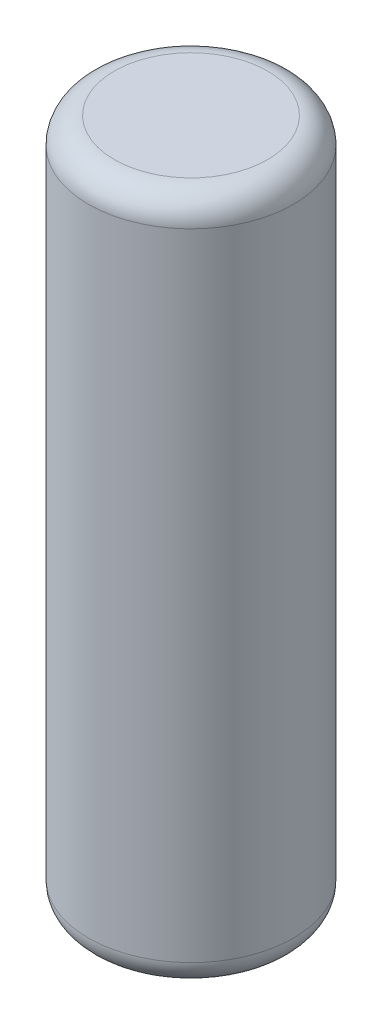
from build123d import *

# Parameters (mm, degrees)
SKETCH1_R      = 1.19
EXTRUDE1_DEPTH = 7.9735
FILLET1_R      = 0.3
FILLET2_R      = 0.3


with BuildPart() as part:
    # Sketch1 → Extrude1 (new body)
    with BuildSketch(Plane(origin=(0, 0, 0), x_dir=(1, 0, 0), z_dir=(0, 1, 0))):
        with Locations(Location((0, 0, 0), (0, 0, 270))):
            Circle(SKETCH1_R)
    extrude(amount=EXTRUDE1_DEPTH)

    # Fillet1
    fillet1_edges = [part.edges().sort_by_distance(p)[0] for p in [
        (0, 7.9735, -1.19),
    ]]
    fillet(fillet1_edges, radius=FILLET1_R)

    # Fillet2
    fillet2_edges = [part.edges().sort_by_distance(p)[0] for p in [
        (0, 0, -1.19),
    ]]
    fillet(fillet2_edges, radius=FILLET2_R)


solid = part.part
